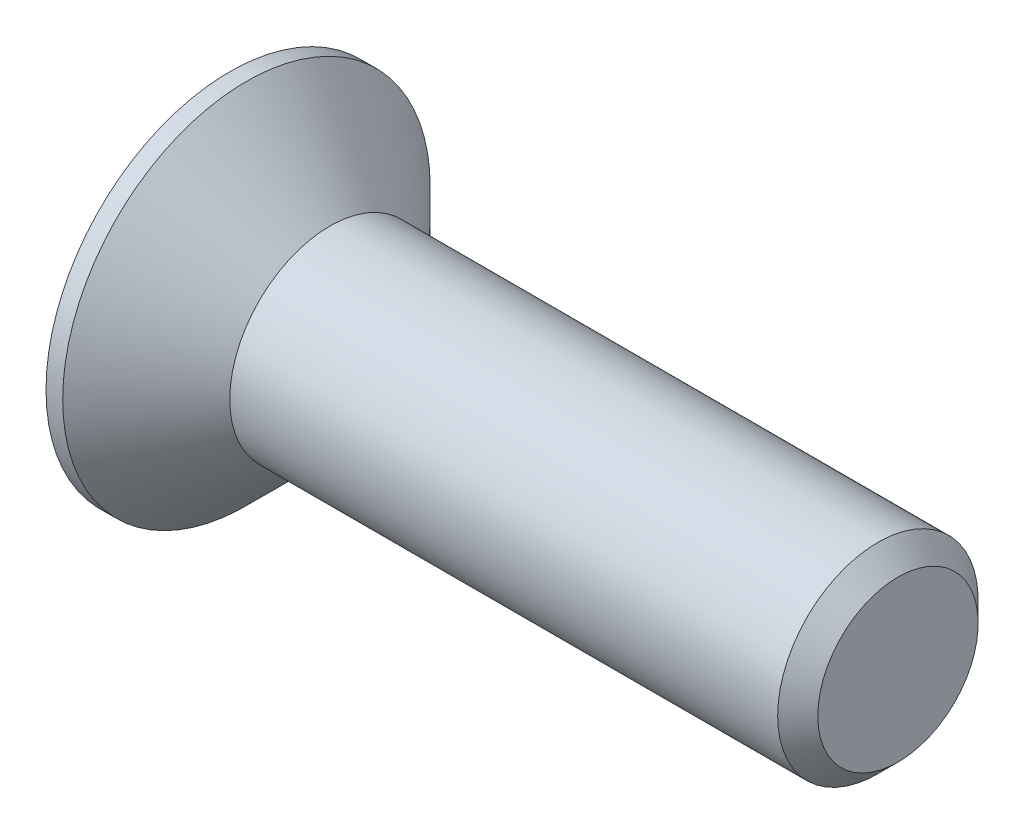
from build123d import *

# Parameters (mm, degrees)
CHAMFER1_SIZE      = 0.6
CUT_EXTRUDE1_DEPTH = 2.5


with BuildPart() as part:
    # Sketch1 → Revolve1 (revolve)
    with BuildSketch(Plane.XY, mode=Mode.PRIVATE) as revolve1_sk:
        Polygon((-3, 5.5), (-3, 0), (17, 0), (17, 3), (0, 3), (-2.5, 5.5), align=None)
    revolve(revolve1_sk.sketch.rotate(Axis((-3, 0, 0), (1, 0, 0)), 90), axis=Axis((-3, 0, 0), (1, 0, 0)))

    # Chamfer1
    chamfer1_edges = [part.edges().sort_by_distance(p)[0] for p in [
        (17, 0, -3),
    ]]
    chamfer(chamfer1_edges, length=CHAMFER1_SIZE)

    # Sketch2 → Cut-Extrude1 (cut)
    with BuildSketch(Plane.ZY.offset(3)):
        Polygon((-0.825, 3.3), (0.825, 3.3), (0.825, 0.825), (3.3, 0.825), (3.3, -0.825), (0.825, -0.825), (0.825, -3.3), (-0.825, -3.3), (-0.825, -0.825), (-3.3, -0.825), (-3.3, 0.825), (-0.825, 0.825), align=None)
    extrude(amount=-CUT_EXTRUDE1_DEPTH, mode=Mode.SUBTRACT)


solid = part.part
